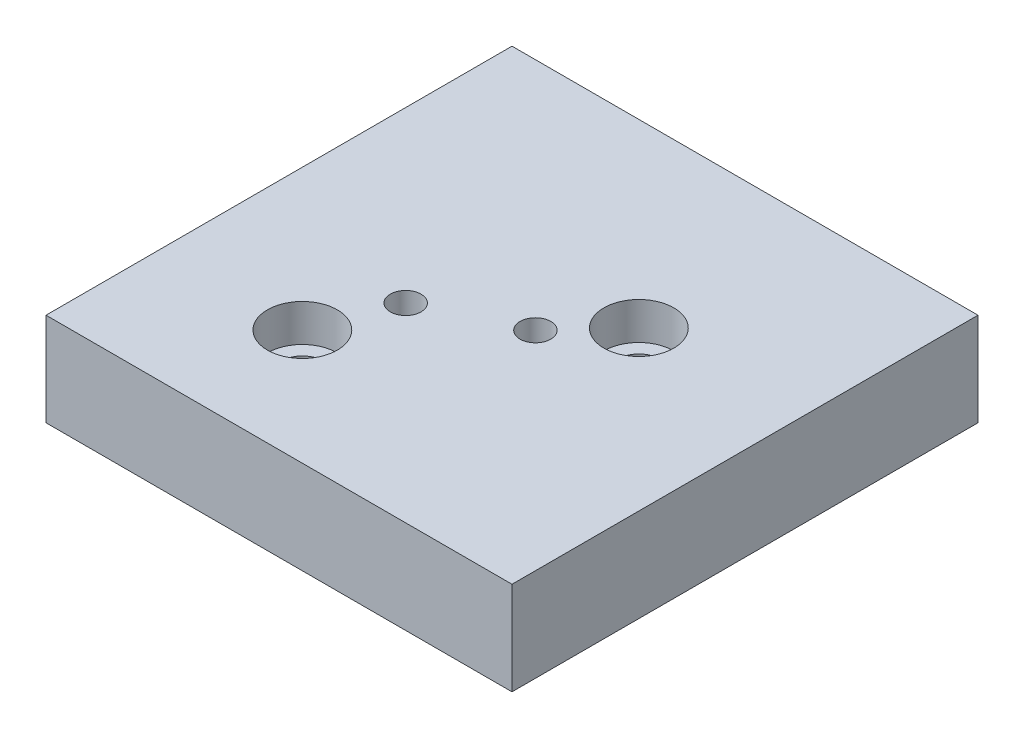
from build123d import *

# Parameters (mm, degrees)
SKIZZE1_W                                            = 100
SKIZZE1_H                                            = 100
LINEAR_AUSTRAGEN1_DEPTH                              = 20
DURCHGANGSLOCH_F_R_M61_D                             = 6.6
STIRNSENKUNG_F_R_M8_ZYLINDERSCHRAUBE_MIT_D           = 9
STIRNSENKUNG_F_R_M8_ZYLINDERSCHRAUBE_MIT_CBORE_D     = 15
STIRNSENKUNG_F_R_M8_ZYLINDERSCHRAUBE_MIT_CBORE_DEPTH = 8
STIRNSENKUNG_F_R_M8_ZYLINDERSCHRAUBE_2_D             = 9
STIRNSENKUNG_F_R_M8_ZYLINDERSCHRAUBE_2_DEPTH         = 13
STIRNSENKUNG_F_R_M8_ZYLINDERSCHRAUBE_2_CBORE_D       = 15
STIRNSENKUNG_F_R_M8_ZYLINDERSCHRAUBE_2_CBORE_DEPTH   = 8
STIRNSENKUNG_F_R_M8_ZYLINDERSCHRAUBE_2_TIP           = 2.703872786


with BuildPart() as part:
    # Skizze1 → Linear austragen1 (new body)
    with BuildSketch(Plane(origin=(0, 0, 0), x_dir=(1, 0, 0), z_dir=(0, 1, 0))):
        with Locations((50, 50)):
            Rectangle(SKIZZE1_W, SKIZZE1_H)
    extrude(amount=LINEAR_AUSTRAGEN1_DEPTH)

    # Durchgangsloch f_r M61 (through all)
    with Locations(Plane(origin=(0, 20, 0), x_dir=(-1, 0, 0), z_dir=(0, 1, 0))):
        with Locations((-55.321076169, -49.709208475), (-36.326804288, -40.856544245)):
            Hole(DURCHGANGSLOCH_F_R_M61_D / 2)

    # Stirnsenkung f_r M8 Zylinderschraube mit (through all)
    with Locations(Plane(origin=(0, 20, 0), x_dir=(-1, 0, 0), z_dir=(0, 1, 0))):
        with Locations((-30.252875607, -24.75923378)):
            CounterBoreHole(STIRNSENKUNG_F_R_M8_ZYLINDERSCHRAUBE_MIT_D / 2, STIRNSENKUNG_F_R_M8_ZYLINDERSCHRAUBE_MIT_CBORE_D / 2, STIRNSENKUNG_F_R_M8_ZYLINDERSCHRAUBE_MIT_CBORE_DEPTH)

    # Stirnsenkung f_r M8 Zylinderschraube 2
    with Locations(Plane(origin=(0, 20, 0), x_dir=(-1, 0, 0), z_dir=(0, 1, 0))):
        with Locations((-65.990147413, -61.231735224)):
            CounterBoreHole(STIRNSENKUNG_F_R_M8_ZYLINDERSCHRAUBE_2_D / 2, STIRNSENKUNG_F_R_M8_ZYLINDERSCHRAUBE_2_CBORE_D / 2, STIRNSENKUNG_F_R_M8_ZYLINDERSCHRAUBE_2_CBORE_DEPTH, depth=STIRNSENKUNG_F_R_M8_ZYLINDERSCHRAUBE_2_DEPTH)
            with Locations((0, 0, -(STIRNSENKUNG_F_R_M8_ZYLINDERSCHRAUBE_2_DEPTH + STIRNSENKUNG_F_R_M8_ZYLINDERSCHRAUBE_2_TIP / 2))):  # 118° drill point
                Cone(0, STIRNSENKUNG_F_R_M8_ZYLINDERSCHRAUBE_2_D / 2, STIRNSENKUNG_F_R_M8_ZYLINDERSCHRAUBE_2_TIP, mode=Mode.SUBTRACT)


solid = part.part
